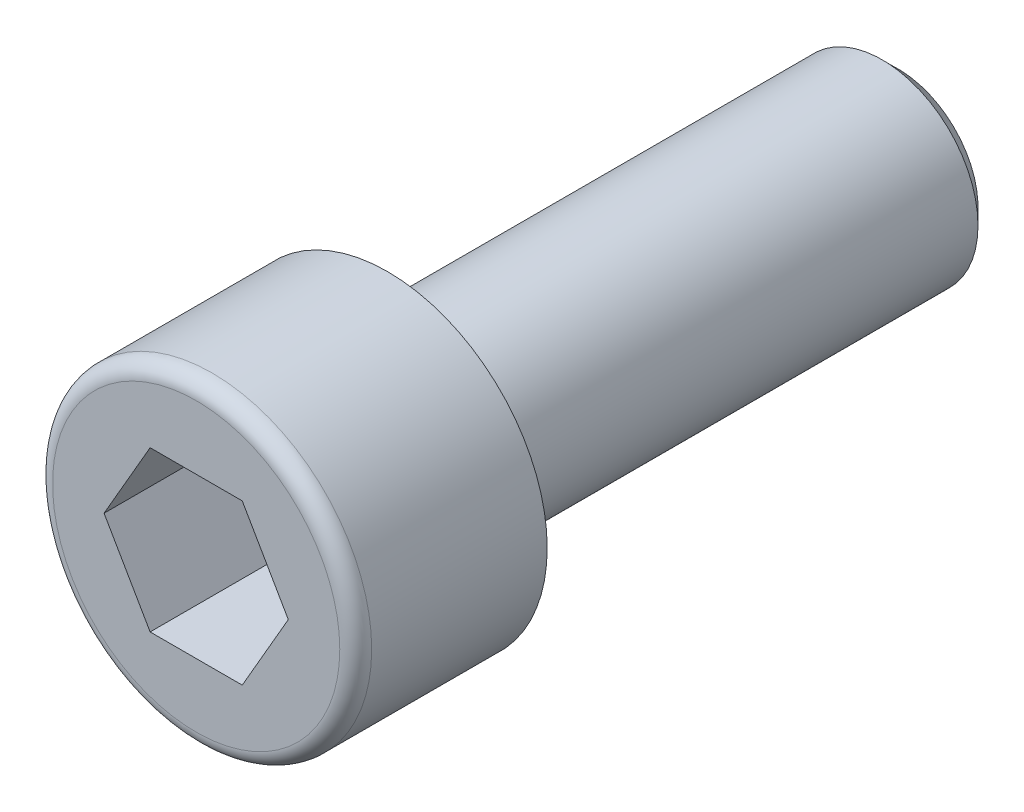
ISO-10303-21;
HEADER;
FILE_DESCRIPTION(('STEP AP214'),'2;1');
FILE_NAME('part.step','',(''),(''),'','','');
FILE_SCHEMA(('AUTOMOTIVE_DESIGN { 1 0 10303 214 1 1 1 1 }'));
ENDSEC;
DATA;
#1=APPLICATION_CONTEXT('core data for automotive mechanical design processes');
#2=APPLICATION_PROTOCOL_DEFINITION('international standard','automotive_design',2000,#1);
#3=PRODUCT_CONTEXT('',#1,'mechanical');
#4=PRODUCT('Part','Part','',(#3));
#5=PRODUCT_RELATED_PRODUCT_CATEGORY('part','',(#4));
#6=PRODUCT_DEFINITION_FORMATION('','',#4);
#7=PRODUCT_DEFINITION_CONTEXT('part definition',#1,'design');
#8=PRODUCT_DEFINITION('design','',#6,#7);
#9=PRODUCT_DEFINITION_SHAPE('','',#8);
#10=(LENGTH_UNIT() NAMED_UNIT(*) SI_UNIT(.MILLI.,.METRE.));
#11=(NAMED_UNIT(*) PLANE_ANGLE_UNIT() SI_UNIT($,.RADIAN.));
#12=(NAMED_UNIT(*) SI_UNIT($,.STERADIAN.) SOLID_ANGLE_UNIT());
#13=UNCERTAINTY_MEASURE_WITH_UNIT(LENGTH_MEASURE(1.E-05),#10,'distance_accuracy_value','');
#14=(GEOMETRIC_REPRESENTATION_CONTEXT(3) GLOBAL_UNCERTAINTY_ASSIGNED_CONTEXT((#13)) GLOBAL_UNIT_ASSIGNED_CONTEXT((#10,
#11,#12)) REPRESENTATION_CONTEXT('',''));
#15=CARTESIAN_POINT('',(0.,0.,0.));
#16=DIRECTION('',(0.,0.,1.));
#17=DIRECTION('',(1.,0.,0.));
#18=AXIS2_PLACEMENT_3D('',#15,#16,#17);
#19=CARTESIAN_POINT('',(0.,0.,0.));
#20=DIRECTION('',(0.,0.,1.));
#21=DIRECTION('',(1.,0.,0.));
#22=AXIS2_PLACEMENT_3D('',#19,#20,#21);
#23=PLANE('',#22);
#24=CARTESIAN_POINT('',(0.,0.,0.));
#25=DIRECTION('',(0.,0.,1.));
#26=DIRECTION('',(1.,0.,0.));
#27=AXIS2_PLACEMENT_3D('',#24,#25,#26);
#28=CIRCLE('',#27,5.);
#29=CARTESIAN_POINT('',(5.,0.,0.));
#30=VERTEX_POINT('',#29);
#31=EDGE_CURVE('E135',#30,#30,#28,.T.);
#32=ORIENTED_EDGE('',*,*,#31,.F.);
#33=EDGE_LOOP('',(#32));
#34=FACE_BOUND('',#33,.T.);
#35=CARTESIAN_POINT('',(0.,0.,0.));
#36=DIRECTION('',(0.,0.,1.));
#37=DIRECTION('',(1.,0.,0.));
#38=AXIS2_PLACEMENT_3D('',#35,#36,#37);
#39=CIRCLE('',#38,3.);
#40=CARTESIAN_POINT('',(3.,0.,0.));
#41=VERTEX_POINT('',#40);
#42=EDGE_CURVE('E144',#41,#41,#39,.F.);
#43=ORIENTED_EDGE('',*,*,#42,.F.);
#44=EDGE_LOOP('',(#43));
#45=FACE_BOUND('',#44,.T.);
#46=ADVANCED_FACE('F33',(#34,#45),#23,.F.);
#47=CARTESIAN_POINT('',(0.,0.,6.00000000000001));
#48=DIRECTION('',(0.,0.,-1.));
#49=DIRECTION('',(-1.,0.,0.));
#50=AXIS2_PLACEMENT_3D('',#47,#48,#49);
#51=CYLINDRICAL_SURFACE('',#50,5.);
#52=CARTESIAN_POINT('',(0.,0.,5.50000000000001));
#53=DIRECTION('',(0.,0.,1.));
#54=DIRECTION('',(1.,0.,0.));
#55=AXIS2_PLACEMENT_3D('',#52,#53,#54);
#56=CIRCLE('',#55,5.);
#57=CARTESIAN_POINT('',(5.,0.,5.50000000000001));
#58=VERTEX_POINT('',#57);
#59=EDGE_CURVE('E150',#58,#58,#56,.F.);
#60=ORIENTED_EDGE('',*,*,#59,.T.);
#61=EDGE_LOOP('',(#60));
#62=FACE_BOUND('',#61,.T.);
#63=ORIENTED_EDGE('',*,*,#31,.T.);
#64=EDGE_LOOP('',(#63));
#65=FACE_BOUND('',#64,.T.);
#66=ADVANCED_FACE('F35',(#62,#65),#51,.T.);
#67=CARTESIAN_POINT('',(0.,0.,6.00000000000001));
#68=DIRECTION('',(0.,0.,1.));
#69=DIRECTION('',(1.,0.,0.));
#70=AXIS2_PLACEMENT_3D('',#67,#68,#69);
#71=PLANE('',#70);
#72=CARTESIAN_POINT('',(0.,0.,6.00000000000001));
#73=DIRECTION('',(0.,0.,1.));
#74=DIRECTION('',(1.,0.,0.));
#75=AXIS2_PLACEMENT_3D('',#72,#73,#74);
#76=CIRCLE('',#75,4.5);
#77=CARTESIAN_POINT('',(4.5,0.,6.00000000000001));
#78=VERTEX_POINT('',#77);
#79=EDGE_CURVE('E147',#78,#78,#76,.T.);
#80=ORIENTED_EDGE('',*,*,#79,.T.);
#81=EDGE_LOOP('',(#80));
#82=FACE_BOUND('',#81,.T.);
#83=DIRECTION('',(0.500000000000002,0.866025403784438,0.));
#84=VECTOR('',#83,1.);
#85=CARTESIAN_POINT('',(1.44337567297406,-2.5,6.00000000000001));
#86=LINE('',#85,#84);
#87=CARTESIAN_POINT('',(1.44337567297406,-2.5,6.00000000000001));
#88=VERTEX_POINT('',#87);
#89=CARTESIAN_POINT('',(2.88675134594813,0.,6.00000000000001));
#90=VERTEX_POINT('',#89);
#91=EDGE_CURVE('E48',#88,#90,#86,.T.);
#92=ORIENTED_EDGE('',*,*,#91,.F.);
#93=DIRECTION('',(1.,0.,0.));
#94=VECTOR('',#93,1.);
#95=CARTESIAN_POINT('',(-1.44337567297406,-2.5,6.00000000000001));
#96=LINE('',#95,#94);
#97=CARTESIAN_POINT('',(-1.44337567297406,-2.5,6.00000000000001));
#98=VERTEX_POINT('',#97);
#99=EDGE_CURVE('E117',#98,#88,#96,.T.);
#100=ORIENTED_EDGE('',*,*,#99,.F.);
#101=DIRECTION('',(0.500000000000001,-0.866025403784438,0.));
#102=VECTOR('',#101,1.);
#103=CARTESIAN_POINT('',(-2.88675134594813,0.,6.00000000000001));
#104=LINE('',#103,#102);
#105=CARTESIAN_POINT('',(-2.88675134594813,0.,6.00000000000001));
#106=VERTEX_POINT('',#105);
#107=EDGE_CURVE('E111',#106,#98,#104,.T.);
#108=ORIENTED_EDGE('',*,*,#107,.F.);
#109=DIRECTION('',(-0.500000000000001,-0.866025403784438,0.));
#110=VECTOR('',#109,1.);
#111=CARTESIAN_POINT('',(-1.44337567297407,2.49999999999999,6.00000000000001));
#112=LINE('',#111,#110);
#113=CARTESIAN_POINT('',(-1.44337567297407,2.49999999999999,6.00000000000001));
#114=VERTEX_POINT('',#113);
#115=EDGE_CURVE('E109',#114,#106,#112,.T.);
#116=ORIENTED_EDGE('',*,*,#115,.F.);
#117=DIRECTION('',(-1.,0.,0.));
#118=VECTOR('',#117,1.);
#119=CARTESIAN_POINT('',(1.44337567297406,2.5,6.00000000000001));
#120=LINE('',#119,#118);
#121=CARTESIAN_POINT('',(1.44337567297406,2.5,6.00000000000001));
#122=VERTEX_POINT('',#121);
#123=EDGE_CURVE('E91',#122,#114,#120,.T.);
#124=ORIENTED_EDGE('',*,*,#123,.F.);
#125=DIRECTION('',(-0.500000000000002,0.866025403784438,0.));
#126=VECTOR('',#125,1.);
#127=CARTESIAN_POINT('',(2.88675134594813,0.,6.00000000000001));
#128=LINE('',#127,#126);
#129=EDGE_CURVE('E102',#90,#122,#128,.T.);
#130=ORIENTED_EDGE('',*,*,#129,.F.);
#131=EDGE_LOOP('',(#92,#100,#108,#116,#124,#130));
#132=FACE_BOUND('',#131,.T.);
#133=ADVANCED_FACE('F106',(#82,#132),#71,.T.);
#134=CARTESIAN_POINT('',(0.,0.,-16.));
#135=DIRECTION('',(0.,0.,1.));
#136=DIRECTION('',(1.,0.,0.));
#137=AXIS2_PLACEMENT_3D('',#134,#135,#136);
#138=CYLINDRICAL_SURFACE('',#137,3.);
#139=CARTESIAN_POINT('',(0.,0.,-15.5));
#140=DIRECTION('',(0.,0.,-1.));
#141=DIRECTION('',(-1.,0.,0.));
#142=AXIS2_PLACEMENT_3D('',#139,#140,#141);
#143=CIRCLE('',#142,3.);
#144=CARTESIAN_POINT('',(-3.,0.,-15.5));
#145=VERTEX_POINT('',#144);
#146=EDGE_CURVE('E11',#145,#145,#143,.F.);
#147=ORIENTED_EDGE('',*,*,#146,.T.);
#148=EDGE_LOOP('',(#147));
#149=FACE_BOUND('',#148,.T.);
#150=ORIENTED_EDGE('',*,*,#42,.T.);
#151=EDGE_LOOP('',(#150));
#152=FACE_BOUND('',#151,.T.);
#153=ADVANCED_FACE('F179',(#149,#152),#138,.T.);
#154=CARTESIAN_POINT('',(0.,0.,-16.));
#155=DIRECTION('',(0.,0.,-1.));
#156=DIRECTION('',(-1.,0.,0.));
#157=AXIS2_PLACEMENT_3D('',#154,#155,#156);
#158=PLANE('',#157);
#159=CARTESIAN_POINT('',(0.,0.,-16.));
#160=DIRECTION('',(0.,0.,-1.));
#161=DIRECTION('',(-1.,0.,0.));
#162=AXIS2_PLACEMENT_3D('',#159,#160,#161);
#163=CIRCLE('',#162,2.49999999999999);
#164=CARTESIAN_POINT('',(-2.49999999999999,0.,-16.));
#165=VERTEX_POINT('',#164);
#166=EDGE_CURVE('E41',#165,#165,#163,.T.);
#167=ORIENTED_EDGE('',*,*,#166,.T.);
#168=EDGE_LOOP('',(#167));
#169=FACE_BOUND('',#168,.T.);
#170=ADVANCED_FACE('F155',(#169),#158,.T.);
#171=CARTESIAN_POINT('',(1.44337567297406,-2.5,2.));
#172=DIRECTION('',(0.866025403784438,-0.500000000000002,0.));
#173=DIRECTION('',(0.500000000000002,0.866025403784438,0.));
#174=AXIS2_PLACEMENT_3D('',#171,#172,#173);
#175=PLANE('',#174);
#176=ORIENTED_EDGE('',*,*,#91,.T.);
#177=DIRECTION('',(0.,0.,1.));
#178=VECTOR('',#177,1.);
#179=CARTESIAN_POINT('',(2.88675134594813,0.,2.));
#180=LINE('',#179,#178);
#181=CARTESIAN_POINT('',(2.88675134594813,0.,2.));
#182=VERTEX_POINT('',#181);
#183=EDGE_CURVE('E99',#182,#90,#180,.T.);
#184=ORIENTED_EDGE('',*,*,#183,.F.);
#185=DIRECTION('',(0.500000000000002,0.866025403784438,0.));
#186=VECTOR('',#185,1.);
#187=CARTESIAN_POINT('',(1.44337567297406,-2.5,2.));
#188=LINE('',#187,#186);
#189=CARTESIAN_POINT('',(1.44337567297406,-2.5,2.));
#190=VERTEX_POINT('',#189);
#191=EDGE_CURVE('E119',#190,#182,#188,.T.);
#192=ORIENTED_EDGE('',*,*,#191,.F.);
#193=DIRECTION('',(0.,0.,1.));
#194=VECTOR('',#193,1.);
#195=CARTESIAN_POINT('',(1.44337567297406,-2.5,2.));
#196=LINE('',#195,#194);
#197=EDGE_CURVE('E55',#190,#88,#196,.T.);
#198=ORIENTED_EDGE('',*,*,#197,.T.);
#199=EDGE_LOOP('',(#176,#184,#192,#198));
#200=FACE_BOUND('',#199,.T.);
#201=ADVANCED_FACE('F192',(#200),#175,.F.);
#202=CARTESIAN_POINT('',(-1.44337567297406,-2.5,2.));
#203=DIRECTION('',(0.,-1.,0.));
#204=DIRECTION('',(1.,0.,0.));
#205=AXIS2_PLACEMENT_3D('',#202,#203,#204);
#206=PLANE('',#205);
#207=ORIENTED_EDGE('',*,*,#99,.T.);
#208=ORIENTED_EDGE('',*,*,#197,.F.);
#209=DIRECTION('',(1.,0.,0.));
#210=VECTOR('',#209,1.);
#211=CARTESIAN_POINT('',(-1.44337567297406,-2.5,2.));
#212=LINE('',#211,#210);
#213=CARTESIAN_POINT('',(-1.44337567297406,-2.5,2.));
#214=VERTEX_POINT('',#213);
#215=EDGE_CURVE('E131',#214,#190,#212,.T.);
#216=ORIENTED_EDGE('',*,*,#215,.F.);
#217=DIRECTION('',(0.,0.,1.));
#218=VECTOR('',#217,1.);
#219=CARTESIAN_POINT('',(-1.44337567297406,-2.5,2.));
#220=LINE('',#219,#218);
#221=EDGE_CURVE('E136',#214,#98,#220,.T.);
#222=ORIENTED_EDGE('',*,*,#221,.T.);
#223=EDGE_LOOP('',(#207,#208,#216,#222));
#224=FACE_BOUND('',#223,.T.);
#225=ADVANCED_FACE('F198',(#224),#206,.F.);
#226=CARTESIAN_POINT('',(-2.88675134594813,0.,2.));
#227=DIRECTION('',(-0.866025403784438,-0.500000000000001,0.));
#228=DIRECTION('',(0.500000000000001,-0.866025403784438,0.));
#229=AXIS2_PLACEMENT_3D('',#226,#227,#228);
#230=PLANE('',#229);
#231=ORIENTED_EDGE('',*,*,#107,.T.);
#232=ORIENTED_EDGE('',*,*,#221,.F.);
#233=DIRECTION('',(0.500000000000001,-0.866025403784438,0.));
#234=VECTOR('',#233,1.);
#235=CARTESIAN_POINT('',(-2.88675134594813,0.,2.));
#236=LINE('',#235,#234);
#237=CARTESIAN_POINT('',(-2.88675134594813,0.,2.));
#238=VERTEX_POINT('',#237);
#239=EDGE_CURVE('E128',#238,#214,#236,.T.);
#240=ORIENTED_EDGE('',*,*,#239,.F.);
#241=DIRECTION('',(0.,0.,1.));
#242=VECTOR('',#241,1.);
#243=CARTESIAN_POINT('',(-2.88675134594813,0.,2.));
#244=LINE('',#243,#242);
#245=EDGE_CURVE('E138',#238,#106,#244,.T.);
#246=ORIENTED_EDGE('',*,*,#245,.T.);
#247=EDGE_LOOP('',(#231,#232,#240,#246));
#248=FACE_BOUND('',#247,.T.);
#249=ADVANCED_FACE('F208',(#248),#230,.F.);
#250=CARTESIAN_POINT('',(-1.44337567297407,2.49999999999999,2.));
#251=DIRECTION('',(-0.866025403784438,0.500000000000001,0.));
#252=DIRECTION('',(-0.500000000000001,-0.866025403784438,0.));
#253=AXIS2_PLACEMENT_3D('',#250,#251,#252);
#254=PLANE('',#253);
#255=ORIENTED_EDGE('',*,*,#115,.T.);
#256=ORIENTED_EDGE('',*,*,#245,.F.);
#257=DIRECTION('',(-0.500000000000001,-0.866025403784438,0.));
#258=VECTOR('',#257,1.);
#259=CARTESIAN_POINT('',(-1.44337567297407,2.49999999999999,2.));
#260=LINE('',#259,#258);
#261=CARTESIAN_POINT('',(-1.44337567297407,2.49999999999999,2.));
#262=VERTEX_POINT('',#261);
#263=EDGE_CURVE('E125',#262,#238,#260,.T.);
#264=ORIENTED_EDGE('',*,*,#263,.F.);
#265=DIRECTION('',(0.,0.,1.));
#266=VECTOR('',#265,1.);
#267=CARTESIAN_POINT('',(-1.44337567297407,2.49999999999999,2.));
#268=LINE('',#267,#266);
#269=EDGE_CURVE('E98',#262,#114,#268,.T.);
#270=ORIENTED_EDGE('',*,*,#269,.T.);
#271=EDGE_LOOP('',(#255,#256,#264,#270));
#272=FACE_BOUND('',#271,.T.);
#273=ADVANCED_FACE('F205',(#272),#254,.F.);
#274=CARTESIAN_POINT('',(1.44337567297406,2.5,2.));
#275=DIRECTION('',(0.,1.,0.));
#276=DIRECTION('',(0.,0.,1.));
#277=AXIS2_PLACEMENT_3D('',#274,#275,#276);
#278=PLANE('',#277);
#279=ORIENTED_EDGE('',*,*,#123,.T.);
#280=ORIENTED_EDGE('',*,*,#269,.F.);
#281=DIRECTION('',(-1.,0.,0.));
#282=VECTOR('',#281,1.);
#283=CARTESIAN_POINT('',(1.44337567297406,2.5,2.));
#284=LINE('',#283,#282);
#285=CARTESIAN_POINT('',(1.44337567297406,2.5,2.));
#286=VERTEX_POINT('',#285);
#287=EDGE_CURVE('E94',#286,#262,#284,.T.);
#288=ORIENTED_EDGE('',*,*,#287,.F.);
#289=DIRECTION('',(0.,0.,1.));
#290=VECTOR('',#289,1.);
#291=CARTESIAN_POINT('',(1.44337567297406,2.5,2.));
#292=LINE('',#291,#290);
#293=EDGE_CURVE('E87',#286,#122,#292,.T.);
#294=ORIENTED_EDGE('',*,*,#293,.T.);
#295=EDGE_LOOP('',(#279,#280,#288,#294));
#296=FACE_BOUND('',#295,.T.);
#297=ADVANCED_FACE('F89',(#296),#278,.F.);
#298=CARTESIAN_POINT('',(2.88675134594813,0.,2.));
#299=DIRECTION('',(0.866025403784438,0.500000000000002,0.));
#300=DIRECTION('',(-0.500000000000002,0.866025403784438,0.));
#301=AXIS2_PLACEMENT_3D('',#298,#299,#300);
#302=PLANE('',#301);
#303=ORIENTED_EDGE('',*,*,#129,.T.);
#304=ORIENTED_EDGE('',*,*,#293,.F.);
#305=DIRECTION('',(-0.500000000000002,0.866025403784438,0.));
#306=VECTOR('',#305,1.);
#307=CARTESIAN_POINT('',(2.88675134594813,0.,2.));
#308=LINE('',#307,#306);
#309=EDGE_CURVE('E122',#182,#286,#308,.T.);
#310=ORIENTED_EDGE('',*,*,#309,.F.);
#311=ORIENTED_EDGE('',*,*,#183,.T.);
#312=EDGE_LOOP('',(#303,#304,#310,#311));
#313=FACE_BOUND('',#312,.T.);
#314=ADVANCED_FACE('F103',(#313),#302,.F.);
#315=CARTESIAN_POINT('',(2.88675134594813,0.,2.));
#316=DIRECTION('',(0.,0.,1.));
#317=DIRECTION('',(1.,0.,0.));
#318=AXIS2_PLACEMENT_3D('',#315,#316,#317);
#319=PLANE('',#318);
#320=ORIENTED_EDGE('',*,*,#191,.T.);
#321=ORIENTED_EDGE('',*,*,#309,.T.);
#322=ORIENTED_EDGE('',*,*,#287,.T.);
#323=ORIENTED_EDGE('',*,*,#263,.T.);
#324=ORIENTED_EDGE('',*,*,#239,.T.);
#325=ORIENTED_EDGE('',*,*,#215,.T.);
#326=EDGE_LOOP('',(#320,#321,#322,#323,#324,#325));
#327=FACE_BOUND('',#326,.T.);
#328=ADVANCED_FACE('F165',(#327),#319,.T.);
#329=CARTESIAN_POINT('',(0.,0.,5.50000000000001));
#330=DIRECTION('',(0.,0.,1.));
#331=DIRECTION('',(1.,0.,0.));
#332=AXIS2_PLACEMENT_3D('',#329,#330,#331);
#333=TOROIDAL_SURFACE('',#332,4.5,0.5);
#334=ORIENTED_EDGE('',*,*,#59,.F.);
#335=EDGE_LOOP('',(#334));
#336=FACE_BOUND('',#335,.T.);
#337=ORIENTED_EDGE('',*,*,#79,.F.);
#338=EDGE_LOOP('',(#337));
#339=FACE_BOUND('',#338,.T.);
#340=ADVANCED_FACE('F159',(#336,#339),#333,.T.);
#341=CARTESIAN_POINT('',(0.,0.,-16.));
#342=DIRECTION('',(0.,0.,1.));
#343=DIRECTION('',(1.,0.,0.));
#344=AXIS2_PLACEMENT_3D('',#341,#342,#343);
#345=CONICAL_SURFACE('',#344,2.49999999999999,0.785398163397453);
#346=ORIENTED_EDGE('',*,*,#146,.F.);
#347=EDGE_LOOP('',(#346));
#348=FACE_BOUND('',#347,.T.);
#349=ORIENTED_EDGE('',*,*,#166,.F.);
#350=EDGE_LOOP('',(#349));
#351=FACE_BOUND('',#350,.T.);
#352=ADVANCED_FACE('F157',(#348,#351),#345,.T.);
#353=CLOSED_SHELL('',(#46,#66,#133,#153,#170,#201,#225,#249,#273,#297,#314,#328,#340,#352));
#354=MANIFOLD_SOLID_BREP('B2',#353);
#355=ADVANCED_BREP_SHAPE_REPRESENTATION('',(#18,#354),#14);
#356=SHAPE_DEFINITION_REPRESENTATION(#9,#355);
ENDSEC;
END-ISO-10303-21;
